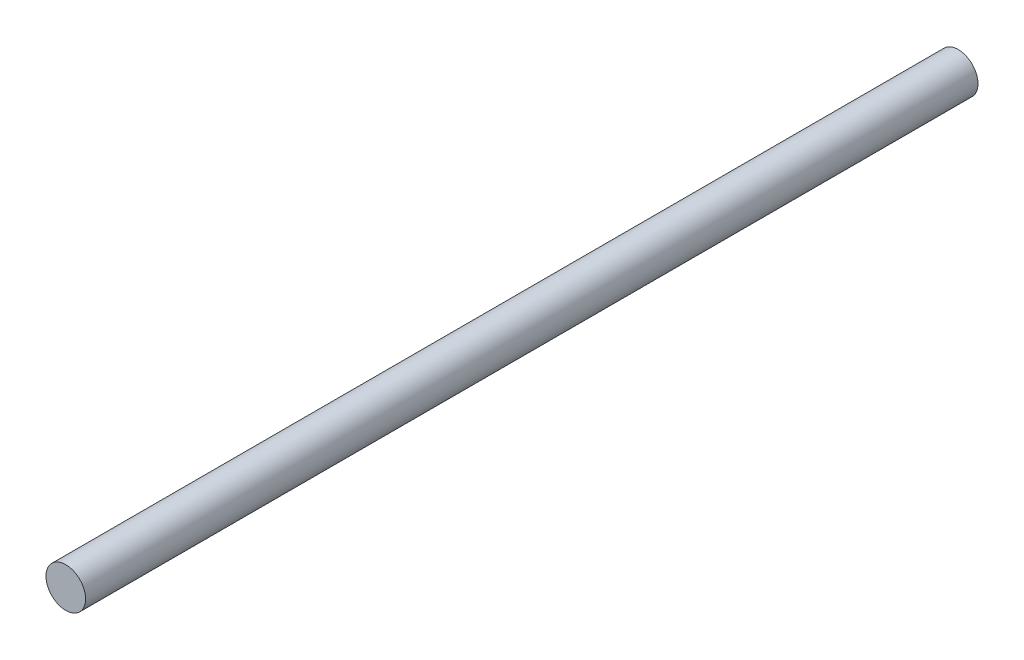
from build123d import *

# Parameters (mm, degrees)
SKETCH1_R           = 30
BOSS_EXTRUDE1_DEPTH = 1350


with BuildPart() as part:
    # Sketch1 → Boss-Extrude1 (new body)
    with BuildSketch(Plane.XY):
        Circle(SKETCH1_R)
    extrude(amount=-BOSS_EXTRUDE1_DEPTH)


solid = part.part
